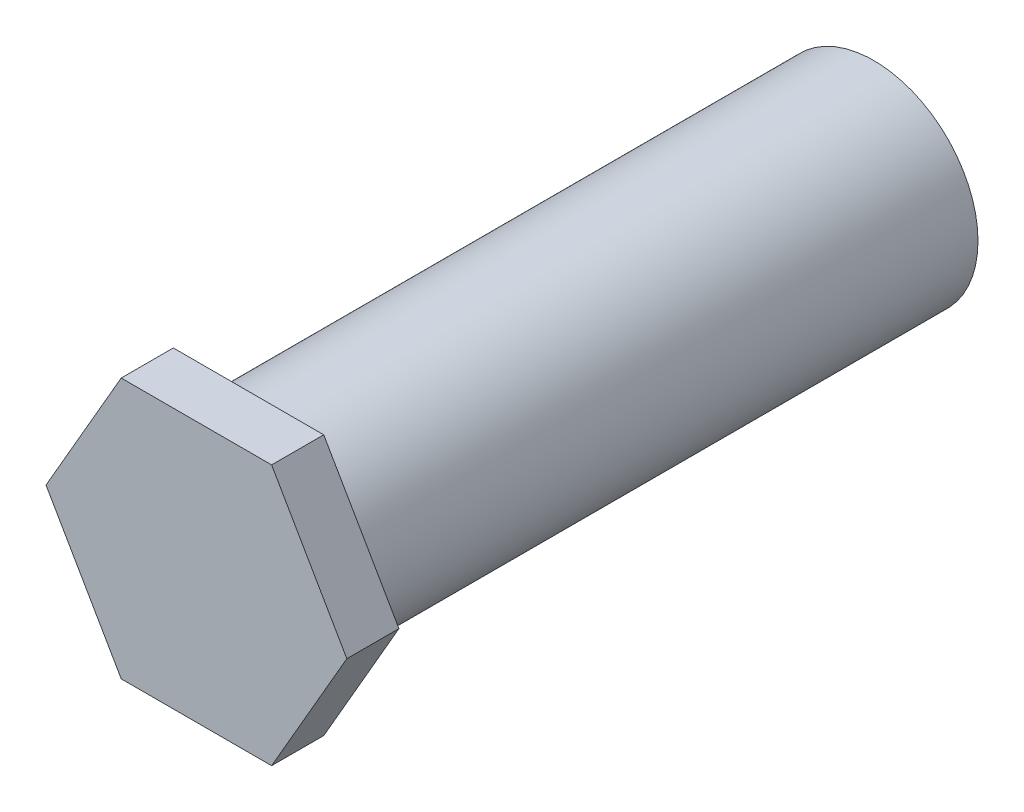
from build123d import *

# Parameters (mm, degrees)
SKETCH1_R      = 10
EXTRUDE1_DEPTH = 60
EXTRUDE2_DEPTH = 5


with BuildPart() as part:
    # Sketch1 → Extrude1 (new body)
    with BuildSketch(Plane.XY):
        with Locations(Location((0, 0, 0), (0, 0, 180))):
            Circle(SKETCH1_R)
    extrude(amount=EXTRUDE1_DEPTH)

    # Sketch2 → Extrude2 (add)
    with BuildSketch(Plane.XY.offset(60)):
        Polygon((14.43375673, 0), (7.216878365, 12.5), (-7.216878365, 12.5), (-14.43375673, 0), (-7.216878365, -12.5), (7.216878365, -12.5), align=None)
    extrude(amount=EXTRUDE2_DEPTH)


solid = part.part
